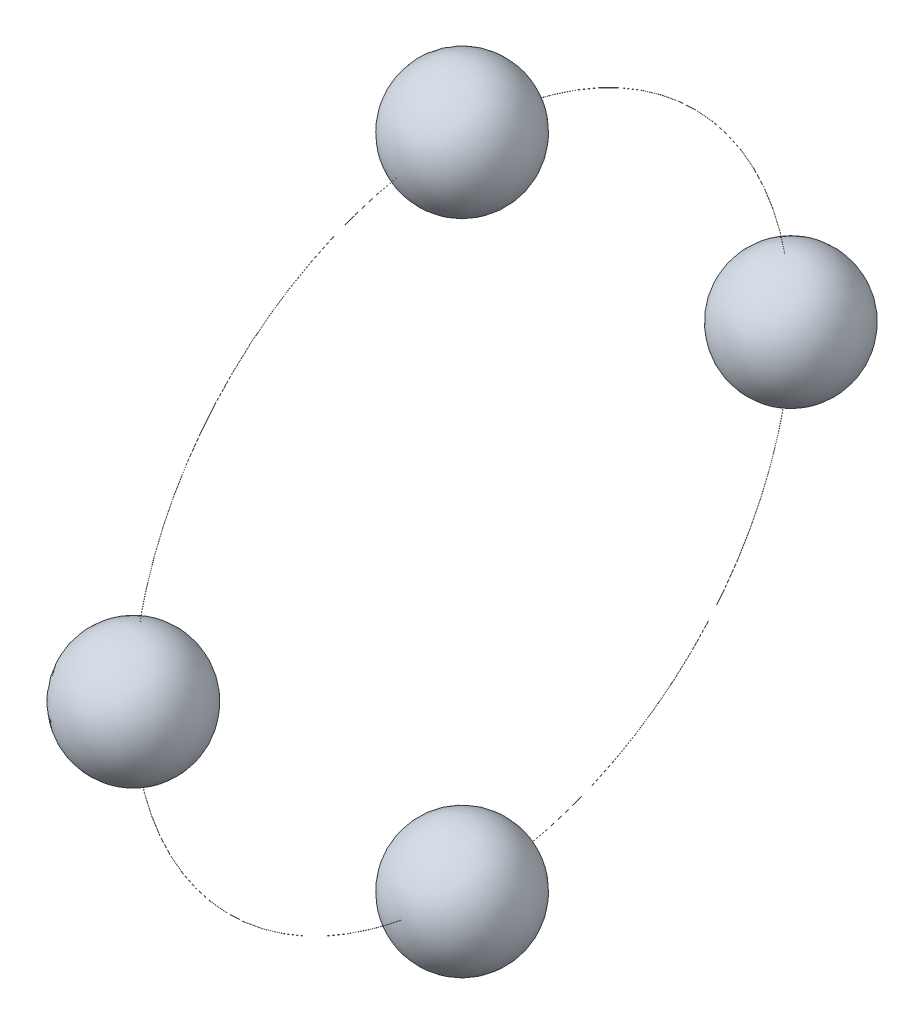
ISO-10303-21;
HEADER;
FILE_DESCRIPTION(('STEP AP214'),'2;1');
FILE_NAME('part.step','',(''),(''),'','','');
FILE_SCHEMA(('AUTOMOTIVE_DESIGN { 1 0 10303 214 1 1 1 1 }'));
ENDSEC;
DATA;
#1=APPLICATION_CONTEXT('core data for automotive mechanical design processes');
#2=APPLICATION_PROTOCOL_DEFINITION('international standard','automotive_design',2000,#1);
#3=PRODUCT_CONTEXT('',#1,'mechanical');
#4=PRODUCT('Part','Part','',(#3));
#5=PRODUCT_RELATED_PRODUCT_CATEGORY('part','',(#4));
#6=PRODUCT_DEFINITION_FORMATION('','',#4);
#7=PRODUCT_DEFINITION_CONTEXT('part definition',#1,'design');
#8=PRODUCT_DEFINITION('design','',#6,#7);
#9=PRODUCT_DEFINITION_SHAPE('','',#8);
#10=(LENGTH_UNIT() NAMED_UNIT(*) SI_UNIT(.MILLI.,.METRE.));
#11=(NAMED_UNIT(*) PLANE_ANGLE_UNIT() SI_UNIT($,.RADIAN.));
#12=(NAMED_UNIT(*) SI_UNIT($,.STERADIAN.) SOLID_ANGLE_UNIT());
#13=UNCERTAINTY_MEASURE_WITH_UNIT(LENGTH_MEASURE(1.E-05),#10,'distance_accuracy_value','');
#14=(GEOMETRIC_REPRESENTATION_CONTEXT(3) GLOBAL_UNCERTAINTY_ASSIGNED_CONTEXT((#13)) GLOBAL_UNIT_ASSIGNED_CONTEXT((#10,
#11,#12)) REPRESENTATION_CONTEXT('',''));
#15=CARTESIAN_POINT('',(0.,0.,0.));
#16=DIRECTION('',(0.,0.,1.));
#17=DIRECTION('',(1.,0.,0.));
#18=AXIS2_PLACEMENT_3D('',#15,#16,#17);
#19=CARTESIAN_POINT('',(3.5,0.,0.));
#20=DIRECTION('',(1.,0.,0.));
#21=DIRECTION('',(0.,-1.,0.));
#22=AXIS2_PLACEMENT_3D('',#19,#20,#21);
#23=TOROIDAL_SURFACE('',#22,10.75,0.002);
#24=CARTESIAN_POINT('',(3.49941893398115,-1.99150567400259,-10.5658674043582));
#25=CARTESIAN_POINT('',(3.49931154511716,-1.99150262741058,-10.5658347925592));
#26=CARTESIAN_POINT('',(3.49920685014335,-1.99149873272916,-10.5657931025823));
#27=CARTESIAN_POINT('',(3.49900590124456,-1.99148935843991,-10.5656927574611));
#28=CARTESIAN_POINT('',(3.49890965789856,-1.99148387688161,-10.5656340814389));
#29=CARTESIAN_POINT('',(3.49872847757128,-1.99147149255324,-10.5655015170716));
#30=CARTESIAN_POINT('',(3.49864353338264,-1.99146459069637,-10.5654276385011));
#31=CARTESIAN_POINT('',(3.49848728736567,-1.99144956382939,-10.5652667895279));
#32=CARTESIAN_POINT('',(3.49841598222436,-1.99144143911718,-10.5651798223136));
#33=CARTESIAN_POINT('',(3.49828876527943,-1.99142416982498,-10.5649949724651));
#34=CARTESIAN_POINT('',(3.49823290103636,-1.99141502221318,-10.5648970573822));
#35=CARTESIAN_POINT('',(3.49813839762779,-1.99139598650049,-10.5646933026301));
#36=CARTESIAN_POINT('',(3.49809975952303,-1.99138609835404,-10.5645874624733));
#37=CARTESIAN_POINT('',(3.49804065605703,-1.99136582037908,-10.5643704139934));
#38=CARTESIAN_POINT('',(3.49802026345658,-1.99135542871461,-10.5642591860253));
#39=CARTESIAN_POINT('',(3.49799847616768,-1.99133447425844,-10.5640349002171));
#40=CARTESIAN_POINT('',(3.49799708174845,-1.99132391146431,-10.5639218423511));
#41=CARTESIAN_POINT('',(3.49801334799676,-1.99130288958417,-10.5636968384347));
#42=CARTESIAN_POINT('',(3.49803105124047,-1.99129243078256,-10.5635848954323));
#43=CARTESIAN_POINT('',(3.4980850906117,-1.9912719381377,-10.5633655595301));
#44=CARTESIAN_POINT('',(3.49812142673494,-1.99126190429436,-10.5632581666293));
#45=CARTESIAN_POINT('',(3.49821169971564,-1.99124255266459,-10.5630510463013));
#46=CARTESIAN_POINT('',(3.49826562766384,-1.99123323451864,-10.5629513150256));
#47=CARTESIAN_POINT('',(3.49838958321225,-1.99121557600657,-10.5627623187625));
#48=CARTESIAN_POINT('',(3.49845961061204,-1.99120723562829,-10.5626730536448));
#49=CARTESIAN_POINT('',(3.49861355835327,-1.99119179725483,-10.5625078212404));
#50=CARTESIAN_POINT('',(3.49869743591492,-1.99118469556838,-10.562431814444));
#51=CARTESIAN_POINT('',(3.49887686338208,-1.99117190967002,-10.5622949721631));
#52=CARTESIAN_POINT('',(3.4989724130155,-1.99116622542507,-10.5622341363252));
#53=CARTESIAN_POINT('',(3.49917203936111,-1.99115646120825,-10.562129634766));
#54=CARTESIAN_POINT('',(3.49927607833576,-1.99115237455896,-10.5620858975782));
#55=CARTESIAN_POINT('',(3.49949007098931,-1.99114589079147,-10.5620165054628));
#56=CARTESIAN_POINT('',(3.49960002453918,-1.99114349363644,-10.561990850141));
#57=CARTESIAN_POINT('',(3.49982230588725,-1.99114046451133,-10.5619584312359));
#58=CARTESIAN_POINT('',(3.49993462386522,-1.99113982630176,-10.5619516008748));
#59=CARTESIAN_POINT('',(3.5001588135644,-1.99114031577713,-10.5619568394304));
#60=CARTESIAN_POINT('',(3.50027068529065,-1.99114144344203,-10.5619689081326));
#61=CARTESIAN_POINT('',(3.50049065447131,-1.9911454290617,-10.5620115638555));
#62=CARTESIAN_POINT('',(3.50059875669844,-1.99114828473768,-10.5620421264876));
#63=CARTESIAN_POINT('',(3.50080828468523,-1.99115564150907,-10.5621208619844));
#64=CARTESIAN_POINT('',(3.50090971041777,-1.99116014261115,-10.5621690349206));
#65=CARTESIAN_POINT('',(3.50110317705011,-1.99117066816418,-10.5622816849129));
#66=CARTESIAN_POINT('',(3.50119520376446,-1.99117669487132,-10.5623461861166));
#67=CARTESIAN_POINT('',(3.50136712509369,-1.99119009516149,-10.5624896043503));
#68=CARTESIAN_POINT('',(3.50144701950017,-1.99119746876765,-10.5625685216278));
#69=CARTESIAN_POINT('',(3.50159272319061,-1.99121338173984,-10.5627388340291));
#70=CARTESIAN_POINT('',(3.5016584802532,-1.99122192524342,-10.5628302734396));
#71=CARTESIAN_POINT('',(3.50177371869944,-1.99123991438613,-10.5630228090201));
#72=CARTESIAN_POINT('',(3.50182319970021,-1.99124936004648,-10.5631239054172));
#73=CARTESIAN_POINT('',(3.50190469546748,-1.99126892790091,-10.5633333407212));
#74=CARTESIAN_POINT('',(3.50193663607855,-1.99127905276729,-10.5634417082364));
#75=CARTESIAN_POINT('',(3.50198185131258,-1.99129965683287,-10.5636622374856));
#76=CARTESIAN_POINT('',(3.50199512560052,-1.99131013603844,-10.5637743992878));
#77=CARTESIAN_POINT('',(3.50200265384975,-1.99133118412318,-10.5639996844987));
#78=CARTESIAN_POINT('',(3.50199685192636,-1.9913417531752,-10.5641128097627));
#79=CARTESIAN_POINT('',(3.5019662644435,-1.99136265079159,-10.5643364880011));
#80=CARTESIAN_POINT('',(3.50194147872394,-1.99137297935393,-10.5644470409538));
#81=CARTESIAN_POINT('',(3.50187359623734,-1.99139310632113,-10.5646624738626));
#82=CARTESIAN_POINT('',(3.50183049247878,-1.99140290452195,-10.5647673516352));
#83=CARTESIAN_POINT('',(3.50172717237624,-1.99142168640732,-10.5649683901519));
#84=CARTESIAN_POINT('',(3.50166695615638,-1.99143067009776,-10.5650645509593));
#85=CARTESIAN_POINT('',(3.50153125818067,-1.99144754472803,-10.5652451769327));
#86=CARTESIAN_POINT('',(3.50145581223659,-1.99145543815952,-10.565329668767));
#87=CARTESIAN_POINT('',(3.50129169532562,-1.99146992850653,-10.5654847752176));
#88=CARTESIAN_POINT('',(3.50120302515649,-1.9914765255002,-10.5655553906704));
#89=CARTESIAN_POINT('',(3.50101536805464,-1.99148820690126,-10.5656804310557));
#90=CARTESIAN_POINT('',(3.50091642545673,-1.99149329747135,-10.565734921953));
#91=CARTESIAN_POINT('',(3.50071070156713,-1.99150185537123,-10.5658265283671));
#92=CARTESIAN_POINT('',(3.5006039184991,-1.99150532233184,-10.5658636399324));
#93=CARTESIAN_POINT('',(3.5003859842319,-1.99151052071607,-10.5659192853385));
#94=CARTESIAN_POINT('',(3.50027484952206,-1.99151225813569,-10.5659378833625));
#95=CARTESIAN_POINT('',(3.5000511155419,-1.99151396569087,-10.5659561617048));
#96=CARTESIAN_POINT('',(3.49993851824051,-1.99151393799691,-10.5659558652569));
#97=CARTESIAN_POINT('',(3.49975769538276,-1.99151247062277,-10.5659401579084));
#98=CARTESIAN_POINT('',(3.49968890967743,-1.99151157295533,-10.5659305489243));
#99=CARTESIAN_POINT('',(3.49955271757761,-1.99150911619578,-10.5659042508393));
#100=CARTESIAN_POINT('',(3.49948531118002,-1.99150755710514,-10.5658875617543));
#101=CARTESIAN_POINT('',(3.49941893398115,-1.99150567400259,-10.5658674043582));
#102=B_SPLINE_CURVE_WITH_KNOTS('',3,(#24,#25,#26,#27,#28,#29,#30,#31,#32,#33,#34,#35,#36,#37,
#38,#39,#40,#41,#42,#43,#44,#45,#46,#47,#48,#49,#50,#51,#52,#53,#54,#55,#56,#57,#58,#59,#60,#61,
#62,#63,#64,#65,#66,#67,#68,#69,#70,#71,#72,#73,#74,#75,#76,#77,#78,#79,#80,#81,#82,#83,#84,#85,
#86,#87,#88,#89,#90,#91,#92,#93,#94,#95,#96,#97,#98,#99,#100,#101),.UNSPECIFIED.,.T.,.F.,(4,2,2,
2,2,2,2,2,2,2,2,2,2,2,2,2,2,2,2,2,2,2,2,2,2,2,2,2,2,2,2,2,2,2,2,2,2,2,4),(0.,
0.000336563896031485,0.000673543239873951,0.00101030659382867,0.00134698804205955,
0.00168469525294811,0.00202242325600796,0.00236149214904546,0.00270056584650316,
0.00304039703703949,0.00338022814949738,0.0037198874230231,0.00405954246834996,
0.00439816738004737,0.00473678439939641,0.00507397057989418,0.0054111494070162,
0.00574713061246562,0.00608310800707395,0.0064186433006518,0.00675417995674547,
0.0070902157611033,0.00742625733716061,0.00776351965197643,0.00810078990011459,
0.00843947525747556,0.00877816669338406,0.00911785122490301,0.00945753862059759,
0.00979735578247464,0.0101371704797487,0.010476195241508,0.0108151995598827,0.0111527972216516,
0.0114904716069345,0.0118269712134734,0.0121630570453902,0.0123710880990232,0.012579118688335),.UNSPECIFIED.);
#103=CARTESIAN_POINT('',(3.49941893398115,-1.99150567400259,-10.5658674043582));
#104=VERTEX_POINT('',#103);
#105=EDGE_CURVE('E10',#104,#104,#102,.T.);
#106=ORIENTED_EDGE('',*,*,#105,.F.);
#107=EDGE_LOOP('',(#106));
#108=FACE_BOUND('',#107,.T.);
#109=CARTESIAN_POINT('',(3.49941893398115,-10.5658674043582,-1.99150567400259));
#110=CARTESIAN_POINT('',(3.4995259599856,-10.5658998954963,-1.99150870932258));
#111=CARTESIAN_POINT('',(3.49963581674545,-10.565923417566,-1.99151090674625));
#112=CARTESIAN_POINT('',(3.49985802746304,-10.5659517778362,-1.99151355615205));
#113=CARTESIAN_POINT('',(3.49997038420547,-10.5659565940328,-1.99151400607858));
#114=CARTESIAN_POINT('',(3.50019427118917,-10.5659473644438,-1.99151314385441));
#115=CARTESIAN_POINT('',(3.50030580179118,-10.5659333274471,-1.99151183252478));
#116=CARTESIAN_POINT('',(3.50052488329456,-10.5658868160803,-1.9915074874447));
#117=CARTESIAN_POINT('',(3.50063243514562,-10.5658543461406,-1.99150445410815));
#118=CARTESIAN_POINT('',(3.50084058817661,-10.5657719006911,-1.99149675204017));
#119=CARTESIAN_POINT('',(3.50094118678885,-10.5657219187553,-1.99149208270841));
#120=CARTESIAN_POINT('',(3.50113256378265,-10.5656058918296,-1.99148124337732));
#121=CARTESIAN_POINT('',(3.50122334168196,-10.5655398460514,-1.99147507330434));
#122=CARTESIAN_POINT('',(3.50139277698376,-10.5653933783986,-1.99146139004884));
#123=CARTESIAN_POINT('',(3.50147139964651,-10.5653129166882,-1.9914538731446));
#124=CARTESIAN_POINT('',(3.50161403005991,-10.5651400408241,-1.99143772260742));
#125=CARTESIAN_POINT('',(3.50167803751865,-10.5650476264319,-1.99142908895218));
#126=CARTESIAN_POINT('',(3.50178990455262,-10.564853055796,-1.99141091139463));
#127=CARTESIAN_POINT('',(3.50183769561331,-10.5647508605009,-1.99140136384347));
#128=CARTESIAN_POINT('',(3.50191544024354,-10.5645399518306,-1.99138165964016));
#129=CARTESIAN_POINT('',(3.50194539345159,-10.5644312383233,-1.99137150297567));
#130=CARTESIAN_POINT('',(3.50198671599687,-10.5642099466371,-1.99135082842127));
#131=CARTESIAN_POINT('',(3.50199801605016,-10.5640973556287,-1.99134030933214));
#132=CARTESIAN_POINT('',(3.50200150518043,-10.5638718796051,-1.99131924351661));
#133=CARTESIAN_POINT('',(3.50199369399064,-10.5637589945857,-1.99130869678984));
#134=CARTESIAN_POINT('',(3.50195914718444,-10.5635359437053,-1.99128785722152));
#135=CARTESIAN_POINT('',(3.50193238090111,-10.5634257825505,-1.99127756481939));
#136=CARTESIAN_POINT('',(3.50186063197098,-10.5632115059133,-1.9912575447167));
#137=CARTESIAN_POINT('',(3.50181564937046,-10.5631073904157,-1.99124781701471));
#138=CARTESIAN_POINT('',(3.50170878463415,-10.5629083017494,-1.99122921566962));
#139=CARTESIAN_POINT('',(3.50164692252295,-10.5628133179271,-1.99122034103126));
#140=CARTESIAN_POINT('',(3.50150800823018,-10.5626350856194,-1.99120368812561));
#141=CARTESIAN_POINT('',(3.50143095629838,-10.562551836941,-1.99119590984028));
#142=CARTESIAN_POINT('',(3.50126413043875,-10.5623997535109,-1.99118169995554));
#143=CARTESIAN_POINT('',(3.50117440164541,-10.5623308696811,-1.99117526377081));
#144=CARTESIAN_POINT('',(3.50098456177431,-10.5622091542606,-1.99116389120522));
#145=CARTESIAN_POINT('',(3.50088445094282,-10.5621563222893,-1.9911589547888));
#146=CARTESIAN_POINT('',(3.50067714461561,-10.5620684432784,-1.99115074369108));
#147=CARTESIAN_POINT('',(3.50056998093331,-10.5620333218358,-1.99114746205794));
#148=CARTESIAN_POINT('',(3.50035124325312,-10.5619815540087,-1.99114262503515));
#149=CARTESIAN_POINT('',(3.50023966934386,-10.5619649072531,-1.99114106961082));
#150=CARTESIAN_POINT('',(3.50001565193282,-10.5619505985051,-1.99113973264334));
#151=CARTESIAN_POINT('',(3.49990321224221,-10.5619528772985,-1.99113994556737));
#152=CARTESIAN_POINT('',(3.4996803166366,-10.561976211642,-1.99114212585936));
#153=CARTESIAN_POINT('',(3.4995698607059,-10.5619972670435,-1.99114409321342));
#154=CARTESIAN_POINT('',(3.49935413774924,-10.5620575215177,-1.99114972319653));
#155=CARTESIAN_POINT('',(3.49924886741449,-10.5620967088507,-1.99115338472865));
#156=CARTESIAN_POINT('',(3.49904640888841,-10.5621920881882,-1.9911622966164));
#157=CARTESIAN_POINT('',(3.49894922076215,-10.5622482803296,-1.99116754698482));
#158=CARTESIAN_POINT('',(3.49876545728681,-10.5623761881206,-1.99117949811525));
#159=CARTESIAN_POINT('',(3.49867890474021,-10.5624479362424,-1.9911862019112));
#160=CARTESIAN_POINT('',(3.49851906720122,-10.562604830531,-1.99120086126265));
#161=CARTESIAN_POINT('',(3.49844578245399,-10.5626899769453,-1.99120881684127));
#162=CARTESIAN_POINT('',(3.49831425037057,-10.5628716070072,-1.99122578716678));
#163=CARTESIAN_POINT('',(3.49825606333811,-10.5629681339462,-1.99123480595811));
#164=CARTESIAN_POINT('',(3.49815671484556,-10.563169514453,-1.99125362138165));
#165=CARTESIAN_POINT('',(3.49811555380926,-10.563274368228,-1.9912634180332));
#166=CARTESIAN_POINT('',(3.49805125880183,-10.5634898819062,-1.99128355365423));
#167=CARTESIAN_POINT('',(3.4980281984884,-10.5636005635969,-1.99129389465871));
#168=CARTESIAN_POINT('',(3.49800101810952,-10.5638242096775,-1.99131478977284));
#169=CARTESIAN_POINT('',(3.4979968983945,-10.5639371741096,-1.99132534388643));
#170=CARTESIAN_POINT('',(3.49800772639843,-10.564162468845,-1.99134639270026));
#171=CARTESIAN_POINT('',(3.49802272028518,-10.5642747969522,-1.99135688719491));
#172=CARTESIAN_POINT('',(3.49807144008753,-10.5644953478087,-1.9913774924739));
#173=CARTESIAN_POINT('',(3.4981051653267,-10.5646035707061,-1.99138760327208));
#174=CARTESIAN_POINT('',(3.49819039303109,-10.5648127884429,-1.99140714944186));
#175=CARTESIAN_POINT('',(3.49824188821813,-10.564913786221,-1.99141658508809));
#176=CARTESIAN_POINT('',(3.49836124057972,-10.5651057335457,-1.99143451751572));
#177=CARTESIAN_POINT('',(3.49842910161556,-10.5651966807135,-1.99144301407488));
#178=CARTESIAN_POINT('',(3.4985790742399,-10.5653656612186,-1.99145880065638));
#179=CARTESIAN_POINT('',(3.49866115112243,-10.5654437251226,-1.99146609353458));
#180=CARTESIAN_POINT('',(3.49883729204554,-10.5655848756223,-1.9914792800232));
#181=CARTESIAN_POINT('',(3.49893134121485,-10.5656479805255,-1.99148517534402));
#182=CARTESIAN_POINT('',(3.4990916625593,-10.5657369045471,-1.99149348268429));
#183=CARTESIAN_POINT('',(3.49915513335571,-10.565767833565,-1.99149637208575));
#184=CARTESIAN_POINT('',(3.49928500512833,-10.5658228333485,-1.99150151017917));
#185=CARTESIAN_POINT('',(3.49935140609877,-10.5658469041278,-1.9915037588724));
#186=CARTESIAN_POINT('',(3.49941893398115,-10.5658674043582,-1.99150567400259));
#187=B_SPLINE_CURVE_WITH_KNOTS('',3,(#109,#110,#111,#112,#113,#114,#115,#116,#117,#118,#119,
#120,#121,#122,#123,#124,#125,#126,#127,#128,#129,#130,#131,#132,#133,#134,#135,#136,#137,#138,
#139,#140,#141,#142,#143,#144,#145,#146,#147,#148,#149,#150,#151,#152,#153,#154,#155,#156,#157,
#158,#159,#160,#161,#162,#163,#164,#165,#166,#167,#168,#169,#170,#171,#172,#173,#174,#175,#176,
#177,#178,#179,#180,#181,#182,#183,#184,#185,#186),.UNSPECIFIED.,.T.,.F.,(4,2,2,2,2,2,2,2,2,2,2,
2,2,2,2,2,2,2,2,2,2,2,2,2,2,2,2,2,2,2,2,2,2,2,2,2,2,2,4),(0.,0.0003354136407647,
0.000671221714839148,0.00100687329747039,0.00134244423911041,0.00167813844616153,
0.00201384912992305,0.00235050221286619,0.00268716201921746,0.00302522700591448,
0.00336329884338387,0.00370262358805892,0.00404195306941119,0.00438183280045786,
0.0047217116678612,0.00506118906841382,0.00540066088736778,0.00573895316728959,
0.00607723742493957,0.00641408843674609,0.00675093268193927,0.0070867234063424,
0.00742251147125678,0.00775808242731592,0.00809365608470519,0.00842993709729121,
0.00876622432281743,0.00910383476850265,0.00944145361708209,0.00978043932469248,
0.0101194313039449,0.0104592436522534,0.0107990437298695,0.0111387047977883,0.0114784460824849,
0.0118173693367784,0.012155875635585,0.0123675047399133,0.0125791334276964),.UNSPECIFIED.);
#188=CARTESIAN_POINT('',(3.49941893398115,-10.5658674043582,-1.99150567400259));
#189=VERTEX_POINT('',#188);
#190=EDGE_CURVE('E35',#189,#189,#187,.T.);
#191=ORIENTED_EDGE('',*,*,#190,.F.);
#192=EDGE_LOOP('',(#191));
#193=FACE_BOUND('',#192,.T.);
#194=ADVANCED_FACE('F14',(#108,#193),#23,.T.);
#195=CARTESIAN_POINT('',(3.49941893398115,1.99150567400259,-10.5658674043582));
#196=CARTESIAN_POINT('',(3.4995259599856,1.99150870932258,-10.5658998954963));
#197=CARTESIAN_POINT('',(3.49963581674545,1.99151090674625,-10.565923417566));
#198=CARTESIAN_POINT('',(3.49985802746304,1.99151355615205,-10.5659517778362));
#199=CARTESIAN_POINT('',(3.49997038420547,1.99151400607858,-10.5659565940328));
#200=CARTESIAN_POINT('',(3.50019427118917,1.99151314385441,-10.5659473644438));
#201=CARTESIAN_POINT('',(3.50030580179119,1.99151183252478,-10.5659333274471));
#202=CARTESIAN_POINT('',(3.50052488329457,1.9915074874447,-10.5658868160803));
#203=CARTESIAN_POINT('',(3.50063243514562,1.99150445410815,-10.5658543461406));
#204=CARTESIAN_POINT('',(3.50084058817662,1.99149675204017,-10.5657719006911));
#205=CARTESIAN_POINT('',(3.50094118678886,1.99149208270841,-10.5657219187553));
#206=CARTESIAN_POINT('',(3.50113256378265,1.99148124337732,-10.5656058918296));
#207=CARTESIAN_POINT('',(3.50122334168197,1.99147507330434,-10.5655398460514));
#208=CARTESIAN_POINT('',(3.50139277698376,1.99146139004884,-10.5653933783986));
#209=CARTESIAN_POINT('',(3.50147139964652,1.9914538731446,-10.5653129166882));
#210=CARTESIAN_POINT('',(3.50161403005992,1.99143772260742,-10.5651400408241));
#211=CARTESIAN_POINT('',(3.50167803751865,1.99142908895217,-10.5650476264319));
#212=CARTESIAN_POINT('',(3.50178990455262,1.99141091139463,-10.5648530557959));
#213=CARTESIAN_POINT('',(3.50183769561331,1.99140136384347,-10.5647508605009));
#214=CARTESIAN_POINT('',(3.50191544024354,1.99138165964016,-10.5645399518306));
#215=CARTESIAN_POINT('',(3.50194539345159,1.99137150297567,-10.5644312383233));
#216=CARTESIAN_POINT('',(3.50198671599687,1.99135082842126,-10.5642099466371));
#217=CARTESIAN_POINT('',(3.50199801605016,1.99134030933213,-10.5640973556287));
#218=CARTESIAN_POINT('',(3.50200150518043,1.99131924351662,-10.5638718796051));
#219=CARTESIAN_POINT('',(3.50199369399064,1.99130869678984,-10.5637589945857));
#220=CARTESIAN_POINT('',(3.50195914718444,1.99128785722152,-10.5635359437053));
#221=CARTESIAN_POINT('',(3.50193238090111,1.99127756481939,-10.5634257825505));
#222=CARTESIAN_POINT('',(3.50186063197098,1.9912575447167,-10.5632115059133));
#223=CARTESIAN_POINT('',(3.50181564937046,1.99124781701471,-10.5631073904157));
#224=CARTESIAN_POINT('',(3.50170878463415,1.99122921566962,-10.5629083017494));
#225=CARTESIAN_POINT('',(3.50164692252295,1.99122034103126,-10.5628133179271));
#226=CARTESIAN_POINT('',(3.50150800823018,1.99120368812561,-10.5626350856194));
#227=CARTESIAN_POINT('',(3.50143095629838,1.99119590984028,-10.562551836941));
#228=CARTESIAN_POINT('',(3.50126413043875,1.99118169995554,-10.5623997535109));
#229=CARTESIAN_POINT('',(3.50117440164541,1.99117526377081,-10.5623308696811));
#230=CARTESIAN_POINT('',(3.50098456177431,1.99116389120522,-10.5622091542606));
#231=CARTESIAN_POINT('',(3.50088445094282,1.9911589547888,-10.5621563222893));
#232=CARTESIAN_POINT('',(3.50067714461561,1.99115074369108,-10.5620684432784));
#233=CARTESIAN_POINT('',(3.50056998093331,1.99114746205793,-10.5620333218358));
#234=CARTESIAN_POINT('',(3.50035124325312,1.99114262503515,-10.5619815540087));
#235=CARTESIAN_POINT('',(3.50023966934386,1.99114106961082,-10.5619649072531));
#236=CARTESIAN_POINT('',(3.50001565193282,1.99113973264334,-10.5619505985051));
#237=CARTESIAN_POINT('',(3.49990321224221,1.99113994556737,-10.5619528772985));
#238=CARTESIAN_POINT('',(3.4996803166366,1.99114212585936,-10.561976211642));
#239=CARTESIAN_POINT('',(3.4995698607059,1.99114409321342,-10.5619972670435));
#240=CARTESIAN_POINT('',(3.49935413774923,1.99114972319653,-10.5620575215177));
#241=CARTESIAN_POINT('',(3.49924886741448,1.99115338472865,-10.5620967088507));
#242=CARTESIAN_POINT('',(3.49904640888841,1.9911622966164,-10.5621920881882));
#243=CARTESIAN_POINT('',(3.49894922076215,1.99116754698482,-10.5622482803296));
#244=CARTESIAN_POINT('',(3.49876545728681,1.99117949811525,-10.5623761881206));
#245=CARTESIAN_POINT('',(3.49867890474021,1.9911862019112,-10.5624479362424));
#246=CARTESIAN_POINT('',(3.49851906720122,1.99120086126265,-10.562604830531));
#247=CARTESIAN_POINT('',(3.49844578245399,1.99120881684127,-10.5626899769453));
#248=CARTESIAN_POINT('',(3.49831425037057,1.99122578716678,-10.5628716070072));
#249=CARTESIAN_POINT('',(3.4982560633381,1.99123480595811,-10.5629681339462));
#250=CARTESIAN_POINT('',(3.49815671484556,1.99125362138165,-10.563169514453));
#251=CARTESIAN_POINT('',(3.49811555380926,1.9912634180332,-10.563274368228));
#252=CARTESIAN_POINT('',(3.49805125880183,1.99128355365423,-10.5634898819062));
#253=CARTESIAN_POINT('',(3.4980281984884,1.99129389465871,-10.5636005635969));
#254=CARTESIAN_POINT('',(3.49800101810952,1.99131478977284,-10.5638242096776));
#255=CARTESIAN_POINT('',(3.4979968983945,1.99132534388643,-10.5639371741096));
#256=CARTESIAN_POINT('',(3.49800772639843,1.99134639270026,-10.564162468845));
#257=CARTESIAN_POINT('',(3.49802272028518,1.99135688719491,-10.5642747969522));
#258=CARTESIAN_POINT('',(3.49807144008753,1.9913774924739,-10.5644953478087));
#259=CARTESIAN_POINT('',(3.4981051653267,1.99138760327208,-10.5646035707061));
#260=CARTESIAN_POINT('',(3.49819039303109,1.99140714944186,-10.5648127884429));
#261=CARTESIAN_POINT('',(3.49824188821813,1.99141658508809,-10.564913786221));
#262=CARTESIAN_POINT('',(3.49836124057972,1.99143451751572,-10.5651057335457));
#263=CARTESIAN_POINT('',(3.49842910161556,1.99144301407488,-10.5651966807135));
#264=CARTESIAN_POINT('',(3.4985790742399,1.99145880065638,-10.5653656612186));
#265=CARTESIAN_POINT('',(3.49866115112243,1.99146609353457,-10.5654437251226));
#266=CARTESIAN_POINT('',(3.49883729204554,1.9914792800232,-10.5655848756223));
#267=CARTESIAN_POINT('',(3.49893134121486,1.99148517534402,-10.5656479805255));
#268=CARTESIAN_POINT('',(3.4990916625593,1.99149348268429,-10.5657369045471));
#269=CARTESIAN_POINT('',(3.49915513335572,1.99149637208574,-10.565767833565));
#270=CARTESIAN_POINT('',(3.49928500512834,1.99150151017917,-10.5658228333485));
#271=CARTESIAN_POINT('',(3.49935140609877,1.9915037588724,-10.5658469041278));
#272=CARTESIAN_POINT('',(3.49941893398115,1.99150567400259,-10.5658674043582));
#273=B_SPLINE_CURVE_WITH_KNOTS('',3,(#195,#196,#197,#198,#199,#200,#201,#202,#203,#204,#205,
#206,#207,#208,#209,#210,#211,#212,#213,#214,#215,#216,#217,#218,#219,#220,#221,#222,#223,#224,
#225,#226,#227,#228,#229,#230,#231,#232,#233,#234,#235,#236,#237,#238,#239,#240,#241,#242,#243,
#244,#245,#246,#247,#248,#249,#250,#251,#252,#253,#254,#255,#256,#257,#258,#259,#260,#261,#262,
#263,#264,#265,#266,#267,#268,#269,#270,#271,#272),.UNSPECIFIED.,.T.,.F.,(4,2,2,2,2,2,2,2,2,2,2,
2,2,2,2,2,2,2,2,2,2,2,2,2,2,2,2,2,2,2,2,2,2,2,2,2,2,2,4),(0.,0.000335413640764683,
0.000671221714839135,0.00100687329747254,0.00134244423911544,0.00167813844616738,
0.00201384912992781,0.00235050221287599,0.00268716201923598,0.00302522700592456,
0.00336329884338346,0.00370262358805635,0.00404195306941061,0.00438183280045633,
0.00472171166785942,0.00506118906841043,0.00540066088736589,0.0057389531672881,
0.00607723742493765,0.0064140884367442,0.00675093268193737,0.00708672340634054,
0.00742251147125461,0.00775808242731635,0.00809365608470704,0.00842993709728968,
0.00876622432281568,0.00910383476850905,0.00944145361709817,0.00978043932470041,
0.0101194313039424,0.0104592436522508,0.010799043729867,0.0111387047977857,0.0114784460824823,
0.0118173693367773,0.0121558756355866,0.0123675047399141,0.0125791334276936),.UNSPECIFIED.);
#274=CARTESIAN_POINT('',(3.49941893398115,1.99150567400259,-10.5658674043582));
#275=VERTEX_POINT('',#274);
#276=EDGE_CURVE('E26',#275,#275,#273,.T.);
#277=ORIENTED_EDGE('',*,*,#276,.F.);
#278=EDGE_LOOP('',(#277));
#279=FACE_BOUND('',#278,.T.);
#280=CARTESIAN_POINT('',(3.49927579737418,10.5620893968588,-1.99115270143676));
#281=CARTESIAN_POINT('',(3.49938005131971,10.5620489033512,-1.99114891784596));
#282=CARTESIAN_POINT('',(3.49948781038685,10.562017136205,-1.99114594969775));
#283=CARTESIAN_POINT('',(3.49970724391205,10.5619720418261,-1.99114173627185));
#284=CARTESIAN_POINT('',(3.49981892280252,10.561958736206,-1.99114049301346));
#285=CARTESIAN_POINT('',(3.50004289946,10.5619509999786,-1.99113977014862));
#286=CARTESIAN_POINT('',(3.50015519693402,10.5619565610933,-1.99114028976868));
#287=CARTESIAN_POINT('',(3.50037722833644,10.5619863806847,-1.99114307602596));
#288=CARTESIAN_POINT('',(3.50048696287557,10.5620106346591,-1.9911453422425));
#289=CARTESIAN_POINT('',(3.50070077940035,10.5620771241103,-1.99115155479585));
#290=CARTESIAN_POINT('',(3.50080486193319,10.5621193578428,-1.99115550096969));
#291=CARTESIAN_POINT('',(3.50100445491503,10.5622205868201,-1.99116495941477));
#292=CARTESIAN_POINT('',(3.50109996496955,10.5622795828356,-1.99117047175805));
#293=CARTESIAN_POINT('',(3.501279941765,10.5624127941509,-1.99118291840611));
#294=CARTESIAN_POINT('',(3.50136438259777,10.5624870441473,-1.99118985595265));
#295=CARTESIAN_POINT('',(3.50151960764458,10.5626485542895,-1.99120494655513));
#296=CARTESIAN_POINT('',(3.50159039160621,10.5627358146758,-1.99121309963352));
#297=CARTESIAN_POINT('',(3.50171659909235,10.5629212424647,-1.99123042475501));
#298=CARTESIAN_POINT('',(3.50177195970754,10.5630194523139,-1.99123960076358));
#299=CARTESIAN_POINT('',(3.50186541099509,10.5632237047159,-1.99125868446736));
#300=CARTESIAN_POINT('',(3.50190350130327,10.5633297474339,-1.991268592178));
#301=CARTESIAN_POINT('',(3.50196148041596,10.5635471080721,-1.99128890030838));
#302=CARTESIAN_POINT('',(3.50198129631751,10.5636584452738,-1.99129930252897));
#303=CARTESIAN_POINT('',(3.50200191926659,10.5638828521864,-1.99132026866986));
#304=CARTESIAN_POINT('',(3.50200272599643,10.5639959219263,-1.99133083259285));
#305=CARTESIAN_POINT('',(3.5019852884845,10.5642208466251,-1.9913518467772));
#306=CARTESIAN_POINT('',(3.50196700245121,10.5643326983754,-1.99136229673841));
#307=CARTESIAN_POINT('',(3.50191182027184,10.5645517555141,-1.99138276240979));
#308=CARTESIAN_POINT('',(3.50187492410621,10.5646589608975,-1.99139277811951));
#309=CARTESIAN_POINT('',(3.50178357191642,10.5648656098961,-1.9914120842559));
#310=CARTESIAN_POINT('',(3.50172912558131,10.5649650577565,-1.99142137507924));
#311=CARTESIAN_POINT('',(3.50160418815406,10.565153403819,-1.99143897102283));
#312=CARTESIAN_POINT('',(3.50153369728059,10.5652423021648,-1.9914472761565));
#313=CARTESIAN_POINT('',(3.50137889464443,10.565406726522,-1.99146263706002));
#314=CARTESIAN_POINT('',(3.50129462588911,10.5654822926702,-1.99146969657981));
#315=CARTESIAN_POINT('',(3.50111449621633,10.5656181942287,-1.99148239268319));
#316=CARTESIAN_POINT('',(3.50101863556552,10.5656785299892,-1.99148802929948));
#317=CARTESIAN_POINT('',(3.50081847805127,10.5657819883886,-1.99149769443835));
#318=CARTESIAN_POINT('',(3.50071421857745,10.5658251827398,-1.99150172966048));
#319=CARTESIAN_POINT('',(3.5004998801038,10.5658934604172,-1.99150810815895));
#320=CARTESIAN_POINT('',(3.50038980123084,10.5659185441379,-1.99151045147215));
#321=CARTESIAN_POINT('',(3.50016736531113,10.5659498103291,-1.99151337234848));
#322=CARTESIAN_POINT('',(3.50005501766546,10.5659560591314,-1.99151395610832));
#323=CARTESIAN_POINT('',(3.49983086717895,10.5659496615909,-1.9915133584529));
#324=CARTESIAN_POINT('',(3.49971906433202,10.5659370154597,-1.99151217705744));
#325=CARTESIAN_POINT('',(3.49949932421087,10.5658932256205,-1.99150808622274));
#326=CARTESIAN_POINT('',(3.4993913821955,10.5658621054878,-1.99150517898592));
#327=CARTESIAN_POINT('',(3.49918226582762,10.565782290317,-1.9914977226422));
#328=CARTESIAN_POINT('',(3.4990810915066,10.565733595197,-1.99149317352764));
#329=CARTESIAN_POINT('',(3.49888820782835,10.5656199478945,-1.99148255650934));
#330=CARTESIAN_POINT('',(3.49879651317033,10.5655549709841,-1.99147648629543));
#331=CARTESIAN_POINT('',(3.49862533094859,10.5654106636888,-1.99146300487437));
#332=CARTESIAN_POINT('',(3.49854584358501,10.5653313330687,-1.99145559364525));
#333=CARTESIAN_POINT('',(3.49840101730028,10.5651602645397,-1.99143961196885));
#334=CARTESIAN_POINT('',(3.49833573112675,10.5650684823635,-1.99143103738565));
#335=CARTESIAN_POINT('',(3.49822148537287,10.5648753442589,-1.99141299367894));
#336=CARTESIAN_POINT('',(3.49817252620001,10.5647739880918,-1.99140352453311));
#337=CARTESIAN_POINT('',(3.49809211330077,10.5645641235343,-1.99138391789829));
#338=CARTESIAN_POINT('',(3.49806073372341,10.5644555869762,-1.9913737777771));
#339=CARTESIAN_POINT('',(3.49801666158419,10.5642348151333,-1.99135315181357));
#340=CARTESIAN_POINT('',(3.49800396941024,10.5641225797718,-1.99134266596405));
#341=CARTESIAN_POINT('',(3.497997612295,10.5638972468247,-1.99132161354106));
#342=CARTESIAN_POINT('',(3.49800400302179,10.5637841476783,-1.99131104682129));
#343=CARTESIAN_POINT('',(3.4980357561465,10.5635606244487,-1.99129016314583));
#344=CARTESIAN_POINT('',(3.49806111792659,10.5634502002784,-1.99127984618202));
#345=CARTESIAN_POINT('',(3.49813011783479,10.5632351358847,-1.99125975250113));
#346=CARTESIAN_POINT('',(3.49817376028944,10.5631304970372,-1.99124997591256));
#347=CARTESIAN_POINT('',(3.49827812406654,10.5629299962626,-1.99123124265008));
#348=CARTESIAN_POINT('',(3.49833884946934,10.5628341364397,-1.99122228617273));
#349=CARTESIAN_POINT('',(3.49847552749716,10.5626541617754,-1.99120547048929));
#350=CARTESIAN_POINT('',(3.49855145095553,10.562570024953,-1.99119760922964));
#351=CARTESIAN_POINT('',(3.4987164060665,10.5624157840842,-1.99118319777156));
#352=CARTESIAN_POINT('',(3.49880542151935,10.5623456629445,-1.99117664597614));
#353=CARTESIAN_POINT('',(3.4989586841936,10.562244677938,-1.99116721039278));
#354=CARTESIAN_POINT('',(3.49901975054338,10.5622089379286,-1.99116387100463));
#355=CARTESIAN_POINT('',(3.49914534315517,10.5621441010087,-1.99115781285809));
#356=CARTESIAN_POINT('',(3.49920986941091,10.562115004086,-1.99115509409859));
#357=CARTESIAN_POINT('',(3.49927579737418,10.5620893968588,-1.99115270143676));
#358=B_SPLINE_CURVE_WITH_KNOTS('',3,(#280,#281,#282,#283,#284,#285,#286,#287,#288,#289,#290,
#291,#292,#293,#294,#295,#296,#297,#298,#299,#300,#301,#302,#303,#304,#305,#306,#307,#308,#309,
#310,#311,#312,#313,#314,#315,#316,#317,#318,#319,#320,#321,#322,#323,#324,#325,#326,#327,#328,
#329,#330,#331,#332,#333,#334,#335,#336,#337,#338,#339,#340,#341,#342,#343,#344,#345,#346,#347,
#348,#349,#350,#351,#352,#353,#354,#355,#356,#357),.UNSPECIFIED.,.T.,.F.,(4,2,2,2,2,2,2,2,2,2,2,
2,2,2,2,2,2,2,2,2,2,2,2,2,2,2,2,2,2,2,2,2,2,2,2,2,2,2,4),(0.,0.000335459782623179,
0.00067131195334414,0.00100701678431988,0.00134264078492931,0.00167823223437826,
0.00201383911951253,0.00235021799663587,0.00268660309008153,0.00302434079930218,
0.00336208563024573,0.00370117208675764,0.00404026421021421,0.00438010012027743,
0.0047199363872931,0.00505958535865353,0.00539922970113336,0.00573783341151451,
0.00607642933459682,0.00641359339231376,0.00675075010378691,0.00708671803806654,
0.00742268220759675,0.00775821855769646,0.00809375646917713,0.00842980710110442,
0.00876586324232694,0.00910314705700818,0.00944043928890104,0.00977914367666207,
0.0101178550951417,0.0104575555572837,0.0107972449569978,0.0111370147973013,0.0114768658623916,
0.0118160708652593,0.0121548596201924,0.0123669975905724,0.0125791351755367),.UNSPECIFIED.);
#359=CARTESIAN_POINT('',(3.49927579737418,10.5620893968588,-1.99115270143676));
#360=VERTEX_POINT('',#359);
#361=EDGE_CURVE('E79',#360,#360,#358,.T.);
#362=ORIENTED_EDGE('',*,*,#361,.F.);
#363=EDGE_LOOP('',(#362));
#364=FACE_BOUND('',#363,.T.);
#365=ADVANCED_FACE('F102',(#279,#364),#23,.T.);
#366=CARTESIAN_POINT('',(3.49941893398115,-10.5658674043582,1.99150567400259));
#367=CARTESIAN_POINT('',(3.49931154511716,-10.5658347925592,1.99150262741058));
#368=CARTESIAN_POINT('',(3.49920685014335,-10.5657931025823,1.99149873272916));
#369=CARTESIAN_POINT('',(3.49900590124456,-10.5656927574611,1.99148935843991));
#370=CARTESIAN_POINT('',(3.49890965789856,-10.5656340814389,1.99148387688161));
#371=CARTESIAN_POINT('',(3.49872847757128,-10.5655015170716,1.99147149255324));
#372=CARTESIAN_POINT('',(3.49864353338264,-10.5654276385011,1.99146459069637));
#373=CARTESIAN_POINT('',(3.49848728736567,-10.5652667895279,1.99144956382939));
#374=CARTESIAN_POINT('',(3.49841598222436,-10.5651798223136,1.99144143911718));
#375=CARTESIAN_POINT('',(3.49828876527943,-10.5649949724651,1.99142416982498));
#376=CARTESIAN_POINT('',(3.49823290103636,-10.5648970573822,1.99141502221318));
#377=CARTESIAN_POINT('',(3.49813839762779,-10.5646933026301,1.99139598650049));
#378=CARTESIAN_POINT('',(3.49809975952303,-10.5645874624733,1.99138609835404));
#379=CARTESIAN_POINT('',(3.49804065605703,-10.5643704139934,1.99136582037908));
#380=CARTESIAN_POINT('',(3.49802026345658,-10.5642591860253,1.99135542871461));
#381=CARTESIAN_POINT('',(3.49799847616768,-10.5640349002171,1.99133447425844));
#382=CARTESIAN_POINT('',(3.49799708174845,-10.5639218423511,1.99132391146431));
#383=CARTESIAN_POINT('',(3.49801334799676,-10.5636968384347,1.99130288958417));
#384=CARTESIAN_POINT('',(3.49803105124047,-10.5635848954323,1.99129243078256));
#385=CARTESIAN_POINT('',(3.4980850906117,-10.5633655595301,1.9912719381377));
#386=CARTESIAN_POINT('',(3.49812142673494,-10.5632581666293,1.99126190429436));
#387=CARTESIAN_POINT('',(3.49821169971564,-10.5630510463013,1.99124255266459));
#388=CARTESIAN_POINT('',(3.49826562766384,-10.5629513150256,1.99123323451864));
#389=CARTESIAN_POINT('',(3.49838958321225,-10.5627623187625,1.99121557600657));
#390=CARTESIAN_POINT('',(3.49845961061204,-10.5626730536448,1.99120723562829));
#391=CARTESIAN_POINT('',(3.49861355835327,-10.5625078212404,1.99119179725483));
#392=CARTESIAN_POINT('',(3.49869743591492,-10.562431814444,1.99118469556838));
#393=CARTESIAN_POINT('',(3.49887686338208,-10.5622949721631,1.99117190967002));
#394=CARTESIAN_POINT('',(3.4989724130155,-10.5622341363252,1.99116622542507));
#395=CARTESIAN_POINT('',(3.49917203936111,-10.562129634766,1.99115646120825));
#396=CARTESIAN_POINT('',(3.49927607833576,-10.5620858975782,1.99115237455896));
#397=CARTESIAN_POINT('',(3.49949007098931,-10.5620165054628,1.99114589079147));
#398=CARTESIAN_POINT('',(3.49960002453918,-10.561990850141,1.99114349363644));
#399=CARTESIAN_POINT('',(3.49982230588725,-10.5619584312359,1.99114046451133));
#400=CARTESIAN_POINT('',(3.49993462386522,-10.5619516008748,1.99113982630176));
#401=CARTESIAN_POINT('',(3.5001588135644,-10.5619568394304,1.99114031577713));
#402=CARTESIAN_POINT('',(3.50027068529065,-10.5619689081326,1.99114144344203));
#403=CARTESIAN_POINT('',(3.50049065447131,-10.5620115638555,1.9911454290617));
#404=CARTESIAN_POINT('',(3.50059875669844,-10.5620421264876,1.99114828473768));
#405=CARTESIAN_POINT('',(3.50080828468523,-10.5621208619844,1.99115564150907));
#406=CARTESIAN_POINT('',(3.50090971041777,-10.5621690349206,1.99116014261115));
#407=CARTESIAN_POINT('',(3.50110317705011,-10.5622816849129,1.99117066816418));
#408=CARTESIAN_POINT('',(3.50119520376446,-10.5623461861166,1.99117669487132));
#409=CARTESIAN_POINT('',(3.50136712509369,-10.5624896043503,1.99119009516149));
#410=CARTESIAN_POINT('',(3.50144701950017,-10.5625685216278,1.99119746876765));
#411=CARTESIAN_POINT('',(3.50159272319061,-10.5627388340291,1.99121338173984));
#412=CARTESIAN_POINT('',(3.5016584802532,-10.5628302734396,1.99122192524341));
#413=CARTESIAN_POINT('',(3.50177371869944,-10.5630228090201,1.99123991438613));
#414=CARTESIAN_POINT('',(3.50182319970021,-10.5631239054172,1.99124936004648));
#415=CARTESIAN_POINT('',(3.50190469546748,-10.5633333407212,1.99126892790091));
#416=CARTESIAN_POINT('',(3.50193663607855,-10.5634417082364,1.99127905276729));
#417=CARTESIAN_POINT('',(3.50198185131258,-10.5636622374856,1.99129965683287));
#418=CARTESIAN_POINT('',(3.50199512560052,-10.5637743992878,1.99131013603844));
#419=CARTESIAN_POINT('',(3.50200265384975,-10.5639996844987,1.99133118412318));
#420=CARTESIAN_POINT('',(3.50199685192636,-10.5641128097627,1.9913417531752));
#421=CARTESIAN_POINT('',(3.5019662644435,-10.5643364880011,1.99136265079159));
#422=CARTESIAN_POINT('',(3.50194147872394,-10.5644470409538,1.99137297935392));
#423=CARTESIAN_POINT('',(3.50187359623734,-10.5646624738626,1.99139310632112));
#424=CARTESIAN_POINT('',(3.50183049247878,-10.5647673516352,1.99140290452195));
#425=CARTESIAN_POINT('',(3.50172717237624,-10.5649683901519,1.99142168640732));
#426=CARTESIAN_POINT('',(3.50166695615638,-10.5650645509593,1.99143067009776));
#427=CARTESIAN_POINT('',(3.50153125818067,-10.5652451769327,1.99144754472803));
#428=CARTESIAN_POINT('',(3.50145581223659,-10.565329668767,1.99145543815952));
#429=CARTESIAN_POINT('',(3.50129169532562,-10.5654847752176,1.99146992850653));
#430=CARTESIAN_POINT('',(3.50120302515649,-10.5655553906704,1.9914765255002));
#431=CARTESIAN_POINT('',(3.50101536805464,-10.5656804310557,1.99148820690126));
#432=CARTESIAN_POINT('',(3.50091642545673,-10.565734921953,1.99149329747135));
#433=CARTESIAN_POINT('',(3.50071070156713,-10.5658265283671,1.99150185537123));
#434=CARTESIAN_POINT('',(3.5006039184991,-10.5658636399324,1.99150532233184));
#435=CARTESIAN_POINT('',(3.5003859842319,-10.5659192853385,1.99151052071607));
#436=CARTESIAN_POINT('',(3.50027484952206,-10.5659378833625,1.99151225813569));
#437=CARTESIAN_POINT('',(3.5000511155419,-10.5659561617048,1.99151396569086));
#438=CARTESIAN_POINT('',(3.49993851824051,-10.5659558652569,1.99151393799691));
#439=CARTESIAN_POINT('',(3.49975769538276,-10.5659401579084,1.99151247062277));
#440=CARTESIAN_POINT('',(3.49968890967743,-10.5659305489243,1.99151157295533));
#441=CARTESIAN_POINT('',(3.49955271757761,-10.5659042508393,1.99150911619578));
#442=CARTESIAN_POINT('',(3.49948531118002,-10.5658875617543,1.99150755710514));
#443=CARTESIAN_POINT('',(3.49941893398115,-10.5658674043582,1.99150567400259));
#444=B_SPLINE_CURVE_WITH_KNOTS('',3,(#366,#367,#368,#369,#370,#371,#372,#373,#374,#375,#376,
#377,#378,#379,#380,#381,#382,#383,#384,#385,#386,#387,#388,#389,#390,#391,#392,#393,#394,#395,
#396,#397,#398,#399,#400,#401,#402,#403,#404,#405,#406,#407,#408,#409,#410,#411,#412,#413,#414,
#415,#416,#417,#418,#419,#420,#421,#422,#423,#424,#425,#426,#427,#428,#429,#430,#431,#432,#433,
#434,#435,#436,#437,#438,#439,#440,#441,#442,#443),.UNSPECIFIED.,.T.,.F.,(4,2,2,2,2,2,2,2,2,2,2,
2,2,2,2,2,2,2,2,2,2,2,2,2,2,2,2,2,2,2,2,2,2,2,2,2,2,2,4),(0.,0.000336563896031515,
0.000673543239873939,0.00101030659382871,0.00134698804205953,0.00168469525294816,
0.00202242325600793,0.00236149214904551,0.00270056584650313,0.00304039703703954,
0.00338022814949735,0.00371988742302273,0.00405954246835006,0.00439816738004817,
0.00473678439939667,0.0050739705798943,0.0054111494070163,0.00574713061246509,
0.00608310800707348,0.00641864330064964,0.00675417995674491,0.00709021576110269,
0.00742625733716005,0.00776351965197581,0.00810078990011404,0.00843947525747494,
0.00877816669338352,0.00911785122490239,0.00945753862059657,0.00979735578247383,
0.0101371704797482,0.0104761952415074,0.0108151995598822,0.0111527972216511,0.011490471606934,
0.0118269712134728,0.0121630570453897,0.0123710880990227,0.0125791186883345),.UNSPECIFIED.);
#445=CARTESIAN_POINT('',(3.49941893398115,-10.5658674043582,1.99150567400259));
#446=VERTEX_POINT('',#445);
#447=EDGE_CURVE('E42',#446,#446,#444,.T.);
#448=ORIENTED_EDGE('',*,*,#447,.F.);
#449=EDGE_LOOP('',(#448));
#450=FACE_BOUND('',#449,.T.);
#451=CARTESIAN_POINT('',(3.49927579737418,-1.99115270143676,10.5620893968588));
#452=CARTESIAN_POINT('',(3.49917111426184,-1.99115650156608,10.5621300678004));
#453=CARTESIAN_POINT('',(3.49906981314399,-1.99116112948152,10.5621795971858));
#454=CARTESIAN_POINT('',(3.49887693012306,-1.99117190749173,10.5622949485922));
#455=CARTESIAN_POINT('',(3.49878536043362,-1.9911780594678,10.5623607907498));
#456=CARTESIAN_POINT('',(3.49861466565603,-1.99119170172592,10.5625067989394));
#457=CARTESIAN_POINT('',(3.49853553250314,-1.9911991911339,10.5625869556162));
#458=CARTESIAN_POINT('',(3.49839187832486,-1.99121529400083,10.5627593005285));
#459=CARTESIAN_POINT('',(3.49832735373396,-1.99122390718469,10.5628514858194));
#460=CARTESIAN_POINT('',(3.49821449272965,-1.99124204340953,10.563045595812));
#461=CARTESIAN_POINT('',(3.49816620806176,-1.9912515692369,10.5631475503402));
#462=CARTESIAN_POINT('',(3.49808744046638,-1.99127123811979,10.5633580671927));
#463=CARTESIAN_POINT('',(3.49805695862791,-1.99128138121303,10.5634666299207));
#464=CARTESIAN_POINT('',(3.49801455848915,-1.99130203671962,10.563687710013));
#465=CARTESIAN_POINT('',(3.49800270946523,-1.99131255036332,10.5638002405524));
#466=CARTESIAN_POINT('',(3.49799811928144,-1.99133361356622,10.564025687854));
#467=CARTESIAN_POINT('',(3.49800537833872,-1.99134416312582,10.5641386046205));
#468=CARTESIAN_POINT('',(3.49803883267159,-1.99136501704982,10.564361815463));
#469=CARTESIAN_POINT('',(3.4980650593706,-1.99137532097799,10.5644721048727));
#470=CARTESIAN_POINT('',(3.49813575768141,-1.99139537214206,10.5646867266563));
#471=CARTESIAN_POINT('',(3.49818022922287,-1.99140511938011,10.5647910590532));
#472=CARTESIAN_POINT('',(3.49828611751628,-1.99142376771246,10.564990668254));
#473=CARTESIAN_POINT('',(3.49834751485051,-1.99143266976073,10.5650859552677));
#474=CARTESIAN_POINT('',(3.49848555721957,-1.99144938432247,10.5652648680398));
#475=CARTESIAN_POINT('',(3.49856220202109,-1.99145719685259,10.5653484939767));
#476=CARTESIAN_POINT('',(3.49872828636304,-1.99147148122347,10.5655013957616));
#477=CARTESIAN_POINT('',(3.49881768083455,-1.99147795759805,10.5655707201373));
#478=CARTESIAN_POINT('',(3.49900693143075,-1.9914894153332,10.5656933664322));
#479=CARTESIAN_POINT('',(3.49910678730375,-1.99149439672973,10.5657466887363));
#480=CARTESIAN_POINT('',(3.49931367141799,-1.9915027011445,10.5658355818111));
#481=CARTESIAN_POINT('',(3.49942066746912,-1.9915060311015,10.5658712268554));
#482=CARTESIAN_POINT('',(3.49963916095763,-1.9915109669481,10.5659240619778));
#483=CARTESIAN_POINT('',(3.49975065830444,-1.99151257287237,10.5659412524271));
#484=CARTESIAN_POINT('',(3.49997461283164,-1.99151401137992,10.5659566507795));
#485=CARTESIAN_POINT('',(3.5000870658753,-1.99151384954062,10.5659549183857));
#486=CARTESIAN_POINT('',(3.5003100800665,-1.99151177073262,10.56593266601));
#487=CARTESIAN_POINT('',(3.50042064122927,-1.99150985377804,10.5659121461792));
#488=CARTESIAN_POINT('',(3.50063665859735,-1.99150432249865,10.5658529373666));
#489=CARTESIAN_POINT('',(3.50074211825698,-1.99150070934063,10.5658142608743));
#490=CARTESIAN_POINT('',(3.50094503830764,-1.99149189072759,10.5657198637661));
#491=CARTESIAN_POINT('',(3.50104249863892,-1.99148668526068,10.5656641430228));
#492=CARTESIAN_POINT('',(3.50122687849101,-1.99147481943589,10.5655371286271));
#493=CARTESIAN_POINT('',(3.50131377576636,-1.99146815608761,10.5654658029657));
#494=CARTESIAN_POINT('',(3.50147436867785,-1.99145357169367,10.565309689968));
#495=CARTESIAN_POINT('',(3.50154806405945,-1.99144565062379,10.565224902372));
#496=CARTESIAN_POINT('',(3.50168047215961,-1.99142874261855,10.565043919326));
#497=CARTESIAN_POINT('',(3.50173912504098,-1.99141975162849,10.5649476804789));
#498=CARTESIAN_POINT('',(3.50183944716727,-1.99140098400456,10.5647467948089));
#499=CARTESIAN_POINT('',(3.50188111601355,-1.99139120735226,10.5646421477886));
#500=CARTESIAN_POINT('',(3.50194645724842,-1.99137110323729,10.5644269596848));
#501=CARTESIAN_POINT('',(3.50197005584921,-1.99136077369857,10.5643163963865));
#502=CARTESIAN_POINT('',(3.50199832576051,-1.99133989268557,10.5640928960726));
#503=CARTESIAN_POINT('',(3.50200299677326,-1.9913293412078,10.5639799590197));
#504=CARTESIAN_POINT('',(3.50199327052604,-1.99130828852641,10.5637546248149));
#505=CARTESIAN_POINT('',(3.50197882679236,-1.99129778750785,10.5636422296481));
#506=CARTESIAN_POINT('',(3.50193118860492,-1.99127715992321,10.5634214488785));
#507=CARTESIAN_POINT('',(3.50189799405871,-1.99126703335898,10.5633130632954));
#508=CARTESIAN_POINT('',(3.50181378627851,-1.99124744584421,10.5631034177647));
#509=CARTESIAN_POINT('',(3.50176277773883,-1.9912379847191,10.5630021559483));
#510=CARTESIAN_POINT('',(3.5016443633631,-1.99121999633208,10.5628096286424));
#511=CARTESIAN_POINT('',(3.5015769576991,-1.99121146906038,10.5627183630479));
#512=CARTESIAN_POINT('',(3.50142785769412,-1.99119561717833,10.5625487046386));
#513=CARTESIAN_POINT('',(3.50134620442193,-1.99118828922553,10.5624702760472));
#514=CARTESIAN_POINT('',(3.50117078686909,-1.99117501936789,10.562328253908));
#515=CARTESIAN_POINT('',(3.50107702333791,-1.99116907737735,10.5622646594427));
#516=CARTESIAN_POINT('',(3.50088047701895,-1.99115877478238,10.5621543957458));
#517=CARTESIAN_POINT('',(3.50077773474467,-1.99115440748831,10.5621076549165));
#518=CARTESIAN_POINT('',(3.50056577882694,-1.99114734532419,10.5620320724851));
#519=CARTESIAN_POINT('',(3.50045656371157,-1.99114465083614,10.5620032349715));
#520=CARTESIAN_POINT('',(3.50023517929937,-1.99114102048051,10.561964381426));
#521=CARTESIAN_POINT('',(3.50012302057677,-1.99114007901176,10.5619543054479));
#522=CARTESIAN_POINT('',(3.49989869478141,-1.99113996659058,10.5619531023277));
#523=CARTESIAN_POINT('',(3.49978652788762,-1.99114079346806,10.5619619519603));
#524=CARTESIAN_POINT('',(3.4996075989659,-1.99114353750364,10.5619913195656));
#525=CARTESIAN_POINT('',(3.49953983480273,-1.99114491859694,10.5620061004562));
#526=CARTESIAN_POINT('',(3.49940621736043,-1.99114832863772,10.5620425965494));
#527=CARTESIAN_POINT('',(3.49934036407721,-1.99115035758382,10.5620643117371));
#528=CARTESIAN_POINT('',(3.49927579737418,-1.99115270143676,10.5620893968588));
#529=B_SPLINE_CURVE_WITH_KNOTS('',3,(#451,#452,#453,#454,#455,#456,#457,#458,#459,#460,#461,
#462,#463,#464,#465,#466,#467,#468,#469,#470,#471,#472,#473,#474,#475,#476,#477,#478,#479,#480,
#481,#482,#483,#484,#485,#486,#487,#488,#489,#490,#491,#492,#493,#494,#495,#496,#497,#498,#499,
#500,#501,#502,#503,#504,#505,#506,#507,#508,#509,#510,#511,#512,#513,#514,#515,#516,#517,#518,
#519,#520,#521,#522,#523,#524,#525,#526,#527,#528),.UNSPECIFIED.,.T.,.F.,(4,2,2,2,2,2,2,2,2,2,2,
2,2,2,2,2,2,2,2,2,2,2,2,2,2,2,2,2,2,2,2,2,2,2,2,2,2,2,4),(0.,0.000336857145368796,
0.000674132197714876,0.00101118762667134,0.00134816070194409,0.00168619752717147,
0.00202425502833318,0.0023635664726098,0.00270288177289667,0.00304276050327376,
0.00338263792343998,0.00372212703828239,0.00406161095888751,0.0043999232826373,
0.0047382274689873,0.00507509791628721,0.00541196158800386,0.00574776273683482,
0.0060835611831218,0.00641912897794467,0.00675469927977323,0.0070909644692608,
0.00742723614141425,0.00776482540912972,0.00810242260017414,0.00844139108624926,
0.00878036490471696,0.00912016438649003,0.00945996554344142,0.00979967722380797,
0.0101393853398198,0.0104781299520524,0.0108168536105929,0.0111541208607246,0.0114914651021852,
0.0118277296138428,0.0121635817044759,0.0123713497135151,0.0125791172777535),.UNSPECIFIED.);
#530=CARTESIAN_POINT('',(3.49927579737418,-1.99115270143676,10.5620893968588));
#531=VERTEX_POINT('',#530);
#532=EDGE_CURVE('E67',#531,#531,#529,.T.);
#533=ORIENTED_EDGE('',*,*,#532,.F.);
#534=EDGE_LOOP('',(#533));
#535=FACE_BOUND('',#534,.T.);
#536=ADVANCED_FACE('F98',(#450,#535),#23,.T.);
#537=CARTESIAN_POINT('',(3.49927579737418,1.99115270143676,10.5620893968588));
#538=CARTESIAN_POINT('',(3.49938005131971,1.99114891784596,10.5620489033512));
#539=CARTESIAN_POINT('',(3.49948781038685,1.99114594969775,10.562017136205));
#540=CARTESIAN_POINT('',(3.49970724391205,1.99114173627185,10.5619720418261));
#541=CARTESIAN_POINT('',(3.49981892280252,1.99114049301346,10.561958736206));
#542=CARTESIAN_POINT('',(3.50004289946,1.99113977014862,10.5619509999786));
#543=CARTESIAN_POINT('',(3.50015519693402,1.99114028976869,10.5619565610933));
#544=CARTESIAN_POINT('',(3.50037722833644,1.99114307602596,10.5619863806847));
#545=CARTESIAN_POINT('',(3.50048696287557,1.9911453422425,10.5620106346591));
#546=CARTESIAN_POINT('',(3.50070077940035,1.99115155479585,10.5620771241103));
#547=CARTESIAN_POINT('',(3.50080486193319,1.99115550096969,10.5621193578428));
#548=CARTESIAN_POINT('',(3.50100445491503,1.99116495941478,10.5622205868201));
#549=CARTESIAN_POINT('',(3.50109996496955,1.99117047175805,10.5622795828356));
#550=CARTESIAN_POINT('',(3.501279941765,1.99118291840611,10.5624127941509));
#551=CARTESIAN_POINT('',(3.50136438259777,1.99118985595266,10.5624870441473));
#552=CARTESIAN_POINT('',(3.50151960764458,1.99120494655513,10.5626485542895));
#553=CARTESIAN_POINT('',(3.50159039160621,1.99121309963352,10.5627358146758));
#554=CARTESIAN_POINT('',(3.50171659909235,1.99123042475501,10.5629212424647));
#555=CARTESIAN_POINT('',(3.50177195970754,1.99123960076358,10.5630194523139));
#556=CARTESIAN_POINT('',(3.50186541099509,1.99125868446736,10.5632237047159));
#557=CARTESIAN_POINT('',(3.50190350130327,1.991268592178,10.5633297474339));
#558=CARTESIAN_POINT('',(3.50196148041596,1.99128890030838,10.5635471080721));
#559=CARTESIAN_POINT('',(3.50198129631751,1.99129930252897,10.5636584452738));
#560=CARTESIAN_POINT('',(3.50200191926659,1.99132026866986,10.5638828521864));
#561=CARTESIAN_POINT('',(3.50200272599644,1.99133083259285,10.5639959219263));
#562=CARTESIAN_POINT('',(3.5019852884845,1.99135184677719,10.5642208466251));
#563=CARTESIAN_POINT('',(3.50196700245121,1.99136229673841,10.5643326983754));
#564=CARTESIAN_POINT('',(3.50191182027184,1.99138276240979,10.5645517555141));
#565=CARTESIAN_POINT('',(3.50187492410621,1.99139277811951,10.5646589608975));
#566=CARTESIAN_POINT('',(3.50178357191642,1.9914120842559,10.5648656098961));
#567=CARTESIAN_POINT('',(3.50172912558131,1.99142137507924,10.5649650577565));
#568=CARTESIAN_POINT('',(3.50160418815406,1.99143897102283,10.565153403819));
#569=CARTESIAN_POINT('',(3.50153369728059,1.9914472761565,10.5652423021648));
#570=CARTESIAN_POINT('',(3.50137889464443,1.99146263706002,10.565406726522));
#571=CARTESIAN_POINT('',(3.50129462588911,1.99146969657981,10.5654822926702));
#572=CARTESIAN_POINT('',(3.50111449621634,1.99148239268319,10.5656181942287));
#573=CARTESIAN_POINT('',(3.50101863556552,1.99148802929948,10.5656785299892));
#574=CARTESIAN_POINT('',(3.50081847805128,1.99149769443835,10.5657819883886));
#575=CARTESIAN_POINT('',(3.50071421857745,1.99150172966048,10.5658251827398));
#576=CARTESIAN_POINT('',(3.50049988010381,1.99150810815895,10.5658934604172));
#577=CARTESIAN_POINT('',(3.50038980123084,1.99151045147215,10.5659185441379));
#578=CARTESIAN_POINT('',(3.50016736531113,1.99151337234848,10.5659498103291));
#579=CARTESIAN_POINT('',(3.50005501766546,1.99151395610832,10.5659560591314));
#580=CARTESIAN_POINT('',(3.49983086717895,1.9915133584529,10.5659496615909));
#581=CARTESIAN_POINT('',(3.49971906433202,1.99151217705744,10.5659370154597));
#582=CARTESIAN_POINT('',(3.49949932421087,1.99150808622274,10.5658932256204));
#583=CARTESIAN_POINT('',(3.4993913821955,1.99150517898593,10.5658621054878));
#584=CARTESIAN_POINT('',(3.49918226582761,1.9914977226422,10.565782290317));
#585=CARTESIAN_POINT('',(3.4990810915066,1.99149317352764,10.565733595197));
#586=CARTESIAN_POINT('',(3.49888820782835,1.99148255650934,10.5656199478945));
#587=CARTESIAN_POINT('',(3.49879651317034,1.99147648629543,10.5655549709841));
#588=CARTESIAN_POINT('',(3.49862533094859,1.99146300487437,10.5654106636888));
#589=CARTESIAN_POINT('',(3.498545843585,1.99145559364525,10.5653313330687));
#590=CARTESIAN_POINT('',(3.49840101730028,1.99143961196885,10.5651602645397));
#591=CARTESIAN_POINT('',(3.49833573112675,1.99143103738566,10.5650684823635));
#592=CARTESIAN_POINT('',(3.49822148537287,1.99141299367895,10.5648753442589));
#593=CARTESIAN_POINT('',(3.49817252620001,1.99140352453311,10.5647739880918));
#594=CARTESIAN_POINT('',(3.49809211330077,1.99138391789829,10.5645641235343));
#595=CARTESIAN_POINT('',(3.49806073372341,1.99137377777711,10.5644555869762));
#596=CARTESIAN_POINT('',(3.49801666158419,1.99135315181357,10.5642348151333));
#597=CARTESIAN_POINT('',(3.49800396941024,1.99134266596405,10.5641225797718));
#598=CARTESIAN_POINT('',(3.497997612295,1.99132161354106,10.5638972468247));
#599=CARTESIAN_POINT('',(3.49800400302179,1.99131104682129,10.5637841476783));
#600=CARTESIAN_POINT('',(3.4980357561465,1.99129016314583,10.5635606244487));
#601=CARTESIAN_POINT('',(3.49806111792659,1.99127984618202,10.5634502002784));
#602=CARTESIAN_POINT('',(3.49813011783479,1.99125975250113,10.5632351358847));
#603=CARTESIAN_POINT('',(3.49817376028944,1.99124997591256,10.5631304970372));
#604=CARTESIAN_POINT('',(3.49827812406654,1.99123124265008,10.5629299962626));
#605=CARTESIAN_POINT('',(3.49833884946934,1.99122228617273,10.5628341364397));
#606=CARTESIAN_POINT('',(3.49847552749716,1.99120547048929,10.5626541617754));
#607=CARTESIAN_POINT('',(3.49855145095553,1.99119760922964,10.562570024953));
#608=CARTESIAN_POINT('',(3.4987164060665,1.99118319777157,10.5624157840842));
#609=CARTESIAN_POINT('',(3.49880542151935,1.99117664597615,10.5623456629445));
#610=CARTESIAN_POINT('',(3.4989586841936,1.99116721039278,10.562244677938));
#611=CARTESIAN_POINT('',(3.49901975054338,1.99116387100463,10.5622089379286));
#612=CARTESIAN_POINT('',(3.49914534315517,1.99115781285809,10.5621441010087));
#613=CARTESIAN_POINT('',(3.49920986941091,1.99115509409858,10.562115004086));
#614=CARTESIAN_POINT('',(3.49927579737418,1.99115270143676,10.5620893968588));
#615=B_SPLINE_CURVE_WITH_KNOTS('',3,(#537,#538,#539,#540,#541,#542,#543,#544,#545,#546,#547,
#548,#549,#550,#551,#552,#553,#554,#555,#556,#557,#558,#559,#560,#561,#562,#563,#564,#565,#566,
#567,#568,#569,#570,#571,#572,#573,#574,#575,#576,#577,#578,#579,#580,#581,#582,#583,#584,#585,
#586,#587,#588,#589,#590,#591,#592,#593,#594,#595,#596,#597,#598,#599,#600,#601,#602,#603,#604,
#605,#606,#607,#608,#609,#610,#611,#612,#613,#614),.UNSPECIFIED.,.T.,.F.,(4,2,2,2,2,2,2,2,2,2,2,
2,2,2,2,2,2,2,2,2,2,2,2,2,2,2,2,2,2,2,2,2,2,2,2,2,2,2,4),(0.,0.000335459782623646,
0.000671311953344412,0.00100701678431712,0.00134264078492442,0.00167823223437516,
0.00201383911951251,0.0023502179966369,0.00268660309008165,0.0030243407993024,
0.00336208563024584,0.00370117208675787,0.00404026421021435,0.00438010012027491,
0.00471993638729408,0.00505958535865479,0.00539922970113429,0.00573783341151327,
0.00607642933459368,0.00641359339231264,0.00675075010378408,0.00708671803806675,
0.00742268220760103,0.00775821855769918,0.00809375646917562,0.008429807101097,
0.00876586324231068,0.00910314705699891,0.00944043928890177,0.00977914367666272,
0.0101178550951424,0.0104575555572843,0.0107972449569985,0.0111370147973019,0.011476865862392,
0.0118160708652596,0.0121548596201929,0.0123669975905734,0.0125791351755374),.UNSPECIFIED.);
#616=CARTESIAN_POINT('',(3.49927579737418,1.99115270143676,10.5620893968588));
#617=VERTEX_POINT('',#616);
#618=EDGE_CURVE('E73',#617,#617,#615,.T.);
#619=ORIENTED_EDGE('',*,*,#618,.F.);
#620=EDGE_LOOP('',(#619));
#621=FACE_BOUND('',#620,.T.);
#622=CARTESIAN_POINT('',(3.49927579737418,10.5620893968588,1.99115270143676));
#623=CARTESIAN_POINT('',(3.49917111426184,10.5621300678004,1.99115650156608));
#624=CARTESIAN_POINT('',(3.49906981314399,10.5621795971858,1.99116112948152));
#625=CARTESIAN_POINT('',(3.49887693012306,10.5622949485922,1.99117190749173));
#626=CARTESIAN_POINT('',(3.49878536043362,10.5623607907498,1.9911780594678));
#627=CARTESIAN_POINT('',(3.49861466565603,10.5625067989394,1.99119170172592));
#628=CARTESIAN_POINT('',(3.49853553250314,10.5625869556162,1.9911991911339));
#629=CARTESIAN_POINT('',(3.49839187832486,10.5627593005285,1.99121529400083));
#630=CARTESIAN_POINT('',(3.49832735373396,10.5628514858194,1.99122390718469));
#631=CARTESIAN_POINT('',(3.49821449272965,10.563045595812,1.99124204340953));
#632=CARTESIAN_POINT('',(3.49816620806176,10.5631475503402,1.9912515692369));
#633=CARTESIAN_POINT('',(3.49808744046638,10.5633580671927,1.99127123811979));
#634=CARTESIAN_POINT('',(3.49805695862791,10.5634666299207,1.99128138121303));
#635=CARTESIAN_POINT('',(3.49801455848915,10.563687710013,1.99130203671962));
#636=CARTESIAN_POINT('',(3.49800270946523,10.5638002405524,1.99131255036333));
#637=CARTESIAN_POINT('',(3.49799811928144,10.564025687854,1.99133361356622));
#638=CARTESIAN_POINT('',(3.49800537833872,10.5641386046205,1.99134416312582));
#639=CARTESIAN_POINT('',(3.49803883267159,10.564361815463,1.99136501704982));
#640=CARTESIAN_POINT('',(3.4980650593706,10.5644721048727,1.99137532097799));
#641=CARTESIAN_POINT('',(3.49813575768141,10.5646867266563,1.99139537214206));
#642=CARTESIAN_POINT('',(3.49818022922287,10.5647910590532,1.99140511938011));
#643=CARTESIAN_POINT('',(3.49828611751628,10.564990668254,1.99142376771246));
#644=CARTESIAN_POINT('',(3.49834751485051,10.5650859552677,1.99143266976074));
#645=CARTESIAN_POINT('',(3.49848555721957,10.5652648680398,1.99144938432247));
#646=CARTESIAN_POINT('',(3.49856220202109,10.5653484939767,1.99145719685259));
#647=CARTESIAN_POINT('',(3.49872828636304,10.5655013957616,1.99147148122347));
#648=CARTESIAN_POINT('',(3.49881768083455,10.5655707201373,1.99147795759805));
#649=CARTESIAN_POINT('',(3.49900693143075,10.5656933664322,1.9914894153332));
#650=CARTESIAN_POINT('',(3.49910678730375,10.5657466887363,1.99149439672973));
#651=CARTESIAN_POINT('',(3.49931367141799,10.5658355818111,1.9915027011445));
#652=CARTESIAN_POINT('',(3.49942066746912,10.5658712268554,1.9915060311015));
#653=CARTESIAN_POINT('',(3.49963916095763,10.5659240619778,1.9915109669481));
#654=CARTESIAN_POINT('',(3.49975065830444,10.5659412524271,1.99151257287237));
#655=CARTESIAN_POINT('',(3.49997461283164,10.5659566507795,1.99151401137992));
#656=CARTESIAN_POINT('',(3.5000870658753,10.5659549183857,1.99151384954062));
#657=CARTESIAN_POINT('',(3.5003100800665,10.56593266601,1.99151177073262));
#658=CARTESIAN_POINT('',(3.50042064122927,10.5659121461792,1.99150985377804));
#659=CARTESIAN_POINT('',(3.50063665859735,10.5658529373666,1.99150432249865));
#660=CARTESIAN_POINT('',(3.50074211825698,10.5658142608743,1.99150070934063));
#661=CARTESIAN_POINT('',(3.50094503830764,10.5657198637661,1.99149189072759));
#662=CARTESIAN_POINT('',(3.50104249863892,10.5656641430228,1.99148668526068));
#663=CARTESIAN_POINT('',(3.50122687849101,10.5655371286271,1.99147481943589));
#664=CARTESIAN_POINT('',(3.50131377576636,10.5654658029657,1.99146815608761));
#665=CARTESIAN_POINT('',(3.50147436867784,10.565309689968,1.99145357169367));
#666=CARTESIAN_POINT('',(3.50154806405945,10.565224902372,1.99144565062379));
#667=CARTESIAN_POINT('',(3.50168047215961,10.565043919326,1.99142874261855));
#668=CARTESIAN_POINT('',(3.50173912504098,10.5649476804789,1.99141975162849));
#669=CARTESIAN_POINT('',(3.50183944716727,10.5647467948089,1.99140098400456));
#670=CARTESIAN_POINT('',(3.50188111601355,10.5646421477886,1.99139120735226));
#671=CARTESIAN_POINT('',(3.50194645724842,10.5644269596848,1.99137110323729));
#672=CARTESIAN_POINT('',(3.50197005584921,10.5643163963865,1.99136077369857));
#673=CARTESIAN_POINT('',(3.50199832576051,10.5640928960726,1.99133989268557));
#674=CARTESIAN_POINT('',(3.50200299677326,10.5639799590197,1.9913293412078));
#675=CARTESIAN_POINT('',(3.50199327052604,10.5637546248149,1.99130828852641));
#676=CARTESIAN_POINT('',(3.50197882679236,10.5636422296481,1.99129778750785));
#677=CARTESIAN_POINT('',(3.50193118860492,10.5634214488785,1.99127715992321));
#678=CARTESIAN_POINT('',(3.50189799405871,10.5633130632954,1.99126703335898));
#679=CARTESIAN_POINT('',(3.50181378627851,10.5631034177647,1.99124744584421));
#680=CARTESIAN_POINT('',(3.50176277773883,10.5630021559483,1.9912379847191));
#681=CARTESIAN_POINT('',(3.50164436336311,10.5628096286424,1.99121999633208));
#682=CARTESIAN_POINT('',(3.5015769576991,10.5627183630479,1.99121146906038));
#683=CARTESIAN_POINT('',(3.50142785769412,10.5625487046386,1.99119561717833));
#684=CARTESIAN_POINT('',(3.50134620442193,10.5624702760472,1.99118828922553));
#685=CARTESIAN_POINT('',(3.50117078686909,10.562328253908,1.99117501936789));
#686=CARTESIAN_POINT('',(3.50107702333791,10.5622646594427,1.99116907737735));
#687=CARTESIAN_POINT('',(3.50088047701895,10.5621543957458,1.99115877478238));
#688=CARTESIAN_POINT('',(3.50077773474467,10.5621076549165,1.99115440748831));
#689=CARTESIAN_POINT('',(3.50056577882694,10.5620320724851,1.99114734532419));
#690=CARTESIAN_POINT('',(3.50045656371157,10.5620032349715,1.99114465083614));
#691=CARTESIAN_POINT('',(3.50023517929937,10.561964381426,1.99114102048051));
#692=CARTESIAN_POINT('',(3.50012302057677,10.5619543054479,1.99114007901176));
#693=CARTESIAN_POINT('',(3.49989869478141,10.5619531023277,1.99113996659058));
#694=CARTESIAN_POINT('',(3.49978652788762,10.5619619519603,1.99114079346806));
#695=CARTESIAN_POINT('',(3.4996075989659,10.5619913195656,1.99114353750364));
#696=CARTESIAN_POINT('',(3.49953983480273,10.5620061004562,1.99114491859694));
#697=CARTESIAN_POINT('',(3.49940621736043,10.5620425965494,1.99114832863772));
#698=CARTESIAN_POINT('',(3.49934036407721,10.5620643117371,1.99115035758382));
#699=CARTESIAN_POINT('',(3.49927579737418,10.5620893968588,1.99115270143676));
#700=B_SPLINE_CURVE_WITH_KNOTS('',3,(#622,#623,#624,#625,#626,#627,#628,#629,#630,#631,#632,
#633,#634,#635,#636,#637,#638,#639,#640,#641,#642,#643,#644,#645,#646,#647,#648,#649,#650,#651,
#652,#653,#654,#655,#656,#657,#658,#659,#660,#661,#662,#663,#664,#665,#666,#667,#668,#669,#670,
#671,#672,#673,#674,#675,#676,#677,#678,#679,#680,#681,#682,#683,#684,#685,#686,#687,#688,#689,
#690,#691,#692,#693,#694,#695,#696,#697,#698,#699),.UNSPECIFIED.,.T.,.F.,(4,2,2,2,2,2,2,2,2,2,2,
2,2,2,2,2,2,2,2,2,2,2,2,2,2,2,2,2,2,2,2,2,2,2,2,2,2,2,4),(0.,0.000336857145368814,
0.00067413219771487,0.00101118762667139,0.00134816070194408,0.00168619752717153,
0.00202425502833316,0.00236356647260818,0.00270288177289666,0.00304276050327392,
0.0033826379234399,0.00372212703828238,0.00406161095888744,0.00439992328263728,
0.00473822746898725,0.00507509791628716,0.00541196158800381,0.00574776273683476,
0.00608356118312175,0.00641912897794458,0.0067546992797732,0.00709096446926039,
0.00742723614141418,0.00776482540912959,0.00810242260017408,0.00844139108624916,
0.0087803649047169,0.00912016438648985,0.00945996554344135,0.00979967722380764,
0.0101393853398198,0.0104781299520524,0.0108168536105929,0.0111541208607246,0.0114914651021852,
0.0118277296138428,0.0121635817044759,0.0123713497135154,0.0125791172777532),.UNSPECIFIED.);
#701=CARTESIAN_POINT('',(3.49927579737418,10.5620893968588,1.99115270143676));
#702=VERTEX_POINT('',#701);
#703=EDGE_CURVE('E84',#702,#702,#700,.T.);
#704=ORIENTED_EDGE('',*,*,#703,.F.);
#705=EDGE_LOOP('',(#704));
#706=FACE_BOUND('',#705,.T.);
#707=ADVANCED_FACE('F16',(#621,#706),#23,.T.);
#708=CARTESIAN_POINT('',(3.5,10.75,0.));
#709=DIRECTION('',(0.,0.,1.));
#710=DIRECTION('',(1.,0.,0.));
#711=AXIS2_PLACEMENT_3D('',#708,#709,#710);
#712=SPHERICAL_SURFACE('',#711,2.);
#713=ORIENTED_EDGE('',*,*,#361,.T.);
#714=EDGE_LOOP('',(#713));
#715=FACE_BOUND('',#714,.T.);
#716=ORIENTED_EDGE('',*,*,#703,.T.);
#717=EDGE_LOOP('',(#716));
#718=FACE_BOUND('',#717,.T.);
#719=ADVANCED_FACE('F87',(#715,#718),#712,.T.);
#720=CARTESIAN_POINT('',(3.5,0.,10.75));
#721=DIRECTION('',(0.,-1.,0.));
#722=DIRECTION('',(1.,0.,0.));
#723=AXIS2_PLACEMENT_3D('',#720,#721,#722);
#724=SPHERICAL_SURFACE('',#723,2.);
#725=ORIENTED_EDGE('',*,*,#532,.T.);
#726=EDGE_LOOP('',(#725));
#727=FACE_BOUND('',#726,.T.);
#728=ORIENTED_EDGE('',*,*,#618,.T.);
#729=EDGE_LOOP('',(#728));
#730=FACE_BOUND('',#729,.T.);
#731=ADVANCED_FACE('F58',(#727,#730),#724,.T.);
#732=CARTESIAN_POINT('',(3.5,-10.75,0.));
#733=DIRECTION('',(0.,0.,-1.));
#734=DIRECTION('',(1.,0.,0.));
#735=AXIS2_PLACEMENT_3D('',#732,#733,#734);
#736=SPHERICAL_SURFACE('',#735,2.);
#737=ORIENTED_EDGE('',*,*,#190,.T.);
#738=EDGE_LOOP('',(#737));
#739=FACE_BOUND('',#738,.T.);
#740=ORIENTED_EDGE('',*,*,#447,.T.);
#741=EDGE_LOOP('',(#740));
#742=FACE_BOUND('',#741,.T.);
#743=ADVANCED_FACE('F53',(#739,#742),#736,.T.);
#744=CARTESIAN_POINT('',(3.5,0.,-10.75));
#745=DIRECTION('',(0.,1.,0.));
#746=DIRECTION('',(1.,0.,0.));
#747=AXIS2_PLACEMENT_3D('',#744,#745,#746);
#748=SPHERICAL_SURFACE('',#747,2.);
#749=ORIENTED_EDGE('',*,*,#105,.T.);
#750=EDGE_LOOP('',(#749));
#751=FACE_BOUND('',#750,.T.);
#752=ORIENTED_EDGE('',*,*,#276,.T.);
#753=EDGE_LOOP('',(#752));
#754=FACE_BOUND('',#753,.T.);
#755=ADVANCED_FACE('F50',(#751,#754),#748,.T.);
#756=CLOSED_SHELL('',(#194,#365,#536,#707,#719,#731,#743,#755));
#757=MANIFOLD_SOLID_BREP('B1',#756);
#758=ADVANCED_BREP_SHAPE_REPRESENTATION('',(#18,#757),#14);
#759=SHAPE_DEFINITION_REPRESENTATION(#9,#758);
ENDSEC;
END-ISO-10303-21;
